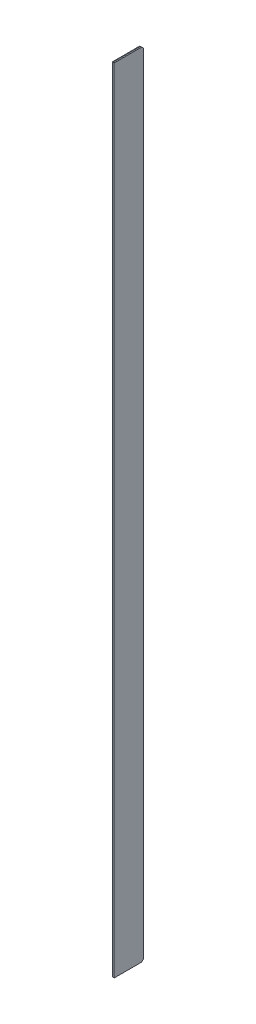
ISO-10303-21;
HEADER;
FILE_DESCRIPTION(('STEP AP214'),'2;1');
FILE_NAME('part.step','',(''),(''),'','','');
FILE_SCHEMA(('AUTOMOTIVE_DESIGN { 1 0 10303 214 1 1 1 1 }'));
ENDSEC;
DATA;
#1=APPLICATION_CONTEXT('core data for automotive mechanical design processes');
#2=APPLICATION_PROTOCOL_DEFINITION('international standard','automotive_design',2000,#1);
#3=PRODUCT_CONTEXT('',#1,'mechanical');
#4=PRODUCT('Part','Part','',(#3));
#5=PRODUCT_RELATED_PRODUCT_CATEGORY('part','',(#4));
#6=PRODUCT_DEFINITION_FORMATION('','',#4);
#7=PRODUCT_DEFINITION_CONTEXT('part definition',#1,'design');
#8=PRODUCT_DEFINITION('design','',#6,#7);
#9=PRODUCT_DEFINITION_SHAPE('','',#8);
#10=(LENGTH_UNIT() NAMED_UNIT(*) SI_UNIT(.MILLI.,.METRE.));
#11=(NAMED_UNIT(*) PLANE_ANGLE_UNIT() SI_UNIT($,.RADIAN.));
#12=(NAMED_UNIT(*) SI_UNIT($,.STERADIAN.) SOLID_ANGLE_UNIT());
#13=UNCERTAINTY_MEASURE_WITH_UNIT(LENGTH_MEASURE(1.E-05),#10,'distance_accuracy_value','');
#14=(GEOMETRIC_REPRESENTATION_CONTEXT(3) GLOBAL_UNCERTAINTY_ASSIGNED_CONTEXT((#13)) GLOBAL_UNIT_ASSIGNED_CONTEXT((#10,
#11,#12)) REPRESENTATION_CONTEXT('',''));
#15=CARTESIAN_POINT('',(0.,0.,0.));
#16=DIRECTION('',(0.,0.,1.));
#17=DIRECTION('',(1.,0.,0.));
#18=AXIS2_PLACEMENT_3D('',#15,#16,#17);
#19=CARTESIAN_POINT('',(19.05,16422.825,304.8));
#20=DIRECTION('',(-1.,0.,0.));
#21=DIRECTION('',(0.,0.,1.));
#22=AXIS2_PLACEMENT_3D('',#19,#20,#21);
#23=PLANE('',#22);
#24=DIRECTION('',(0.,-0.707106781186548,0.707106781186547));
#25=VECTOR('',#24,1.);
#26=CARTESIAN_POINT('',(19.05,0.,-249.8));
#27=LINE('',#26,#25);
#28=CARTESIAN_POINT('',(19.05,55.,-304.8));
#29=VERTEX_POINT('',#28);
#30=CARTESIAN_POINT('',(19.05,12.9999999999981,-262.799999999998));
#31=VERTEX_POINT('',#30);
#32=EDGE_CURVE('E65',#29,#31,#27,.T.);
#33=ORIENTED_EDGE('',*,*,#32,.F.);
#34=DIRECTION('',(0.,-1.,0.));
#35=VECTOR('',#34,1.);
#36=CARTESIAN_POINT('',(19.05,16422.825,-304.8));
#37=LINE('',#36,#35);
#38=CARTESIAN_POINT('',(19.05,16367.825,-304.8));
#39=VERTEX_POINT('',#38);
#40=EDGE_CURVE('E139',#39,#29,#37,.T.);
#41=ORIENTED_EDGE('',*,*,#40,.F.);
#42=DIRECTION('',(0.,-0.707106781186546,-0.707106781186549));
#43=VECTOR('',#42,1.);
#44=CARTESIAN_POINT('',(19.05,16422.825,-249.8));
#45=LINE('',#44,#43);
#46=CARTESIAN_POINT('',(19.05,16409.825,-262.800000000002));
#47=VERTEX_POINT('',#46);
#48=EDGE_CURVE('E142',#47,#39,#45,.T.);
#49=ORIENTED_EDGE('',*,*,#48,.F.);
#50=DIRECTION('',(0.,0.,1.));
#51=VECTOR('',#50,1.);
#52=CARTESIAN_POINT('',(19.05,16409.825,304.8));
#53=LINE('',#52,#51);
#54=CARTESIAN_POINT('',(19.05,16409.825,304.8));
#55=VERTEX_POINT('',#54);
#56=EDGE_CURVE('E176',#47,#55,#53,.T.);
#57=ORIENTED_EDGE('',*,*,#56,.T.);
#58=DIRECTION('',(0.,-1.,0.));
#59=VECTOR('',#58,1.);
#60=CARTESIAN_POINT('',(19.05,16422.825,304.8));
#61=LINE('',#60,#59);
#62=CARTESIAN_POINT('',(19.05,12.9999999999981,304.8));
#63=VERTEX_POINT('',#62);
#64=EDGE_CURVE('E146',#55,#63,#61,.T.);
#65=ORIENTED_EDGE('',*,*,#64,.T.);
#66=DIRECTION('',(0.,0.,-1.));
#67=VECTOR('',#66,1.);
#68=CARTESIAN_POINT('',(19.05,12.9999999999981,304.8));
#69=LINE('',#68,#67);
#70=EDGE_CURVE('E136',#63,#31,#69,.T.);
#71=ORIENTED_EDGE('',*,*,#70,.T.);
#72=EDGE_LOOP('',(#33,#41,#49,#57,#65,#71));
#73=FACE_BOUND('',#72,.T.);
#74=ADVANCED_FACE('F46',(#73),#23,.F.);
#75=CARTESIAN_POINT('',(19.05,16422.825,-304.8));
#76=DIRECTION('',(0.,0.,1.));
#77=DIRECTION('',(1.,0.,0.));
#78=AXIS2_PLACEMENT_3D('',#75,#76,#77);
#79=PLANE('',#78);
#80=DIRECTION('',(1.,0.,0.));
#81=VECTOR('',#80,1.);
#82=CARTESIAN_POINT('',(-19.05,55.,-304.8));
#83=LINE('',#82,#81);
#84=CARTESIAN_POINT('',(-19.05,55.,-304.8));
#85=VERTEX_POINT('',#84);
#86=EDGE_CURVE('E124',#85,#29,#83,.T.);
#87=ORIENTED_EDGE('',*,*,#86,.F.);
#88=DIRECTION('',(0.,-1.,0.));
#89=VECTOR('',#88,1.);
#90=CARTESIAN_POINT('',(-19.05,16422.825,-304.8));
#91=LINE('',#90,#89);
#92=CARTESIAN_POINT('',(-19.05,16367.825,-304.8));
#93=VERTEX_POINT('',#92);
#94=EDGE_CURVE('E149',#93,#85,#91,.T.);
#95=ORIENTED_EDGE('',*,*,#94,.F.);
#96=DIRECTION('',(1.,0.,0.));
#97=VECTOR('',#96,1.);
#98=CARTESIAN_POINT('',(-19.05,16367.825,-304.8));
#99=LINE('',#98,#97);
#100=EDGE_CURVE('E148',#93,#39,#99,.T.);
#101=ORIENTED_EDGE('',*,*,#100,.T.);
#102=ORIENTED_EDGE('',*,*,#40,.T.);
#103=EDGE_LOOP('',(#87,#95,#101,#102));
#104=FACE_BOUND('',#103,.T.);
#105=ADVANCED_FACE('F144',(#104),#79,.F.);
#106=CARTESIAN_POINT('',(-19.05,16422.825,304.8));
#107=DIRECTION('',(1.,0.,0.));
#108=DIRECTION('',(0.,0.,-1.));
#109=AXIS2_PLACEMENT_3D('',#106,#107,#108);
#110=PLANE('',#109);
#111=ORIENTED_EDGE('',*,*,#94,.T.);
#112=DIRECTION('',(0.,-0.707106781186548,0.707106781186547));
#113=VECTOR('',#112,1.);
#114=CARTESIAN_POINT('',(-19.05,0.,-249.8));
#115=LINE('',#114,#113);
#116=CARTESIAN_POINT('',(-19.05,12.9999999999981,-262.799999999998));
#117=VERTEX_POINT('',#116);
#118=EDGE_CURVE('E121',#85,#117,#115,.T.);
#119=ORIENTED_EDGE('',*,*,#118,.T.);
#120=DIRECTION('',(0.,0.,1.));
#121=VECTOR('',#120,1.);
#122=CARTESIAN_POINT('',(-19.05,12.9999999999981,304.8));
#123=LINE('',#122,#121);
#124=CARTESIAN_POINT('',(-19.05,12.9999999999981,304.8));
#125=VERTEX_POINT('',#124);
#126=EDGE_CURVE('E189',#117,#125,#123,.T.);
#127=ORIENTED_EDGE('',*,*,#126,.T.);
#128=DIRECTION('',(0.,-1.,0.));
#129=VECTOR('',#128,1.);
#130=CARTESIAN_POINT('',(-19.05,16422.825,304.8));
#131=LINE('',#130,#129);
#132=CARTESIAN_POINT('',(-19.05,16409.825,304.8));
#133=VERTEX_POINT('',#132);
#134=EDGE_CURVE('E153',#133,#125,#131,.T.);
#135=ORIENTED_EDGE('',*,*,#134,.F.);
#136=DIRECTION('',(0.,0.,-1.));
#137=VECTOR('',#136,1.);
#138=CARTESIAN_POINT('',(-19.05,16409.825,-304.8));
#139=LINE('',#138,#137);
#140=CARTESIAN_POINT('',(-19.05,16409.825,-262.800000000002));
#141=VERTEX_POINT('',#140);
#142=EDGE_CURVE('E183',#133,#141,#139,.T.);
#143=ORIENTED_EDGE('',*,*,#142,.T.);
#144=DIRECTION('',(0.,-0.707106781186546,-0.707106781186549));
#145=VECTOR('',#144,1.);
#146=CARTESIAN_POINT('',(-19.05,16422.825,-249.8));
#147=LINE('',#146,#145);
#148=EDGE_CURVE('E66',#141,#93,#147,.T.);
#149=ORIENTED_EDGE('',*,*,#148,.T.);
#150=EDGE_LOOP('',(#111,#119,#127,#135,#143,#149));
#151=FACE_BOUND('',#150,.T.);
#152=ADVANCED_FACE('F255',(#151),#110,.F.);
#153=CARTESIAN_POINT('',(19.05,16422.825,304.8));
#154=DIRECTION('',(0.,0.,-1.));
#155=DIRECTION('',(-1.,0.,0.));
#156=AXIS2_PLACEMENT_3D('',#153,#154,#155);
#157=PLANE('',#156);
#158=ORIENTED_EDGE('',*,*,#134,.T.);
#159=DIRECTION('',(1.,0.,0.));
#160=VECTOR('',#159,1.);
#161=CARTESIAN_POINT('',(19.05,12.9999999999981,304.8));
#162=LINE('',#161,#160);
#163=EDGE_CURVE('E164',#125,#63,#162,.T.);
#164=ORIENTED_EDGE('',*,*,#163,.T.);
#165=ORIENTED_EDGE('',*,*,#64,.F.);
#166=DIRECTION('',(-1.,0.,0.));
#167=VECTOR('',#166,1.);
#168=CARTESIAN_POINT('',(-19.05,16409.825,304.8));
#169=LINE('',#168,#167);
#170=EDGE_CURVE('E165',#55,#133,#169,.T.);
#171=ORIENTED_EDGE('',*,*,#170,.T.);
#172=EDGE_LOOP('',(#158,#164,#165,#171));
#173=FACE_BOUND('',#172,.T.);
#174=ADVANCED_FACE('F268',(#173),#157,.F.);
#175=CARTESIAN_POINT('',(0.,16422.825,0.));
#176=DIRECTION('',(0.,1.,0.));
#177=DIRECTION('',(0.,0.,1.));
#178=AXIS2_PLACEMENT_3D('',#175,#176,#177);
#179=PLANE('',#178);
#180=DIRECTION('',(1.,0.,0.));
#181=VECTOR('',#180,1.);
#182=CARTESIAN_POINT('',(-19.05,16422.825,-249.8));
#183=LINE('',#182,#181);
#184=CARTESIAN_POINT('',(-6.04999999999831,16422.825,-249.8));
#185=VERTEX_POINT('',#184);
#186=CARTESIAN_POINT('',(6.04999999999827,16422.825,-249.8));
#187=VERTEX_POINT('',#186);
#188=EDGE_CURVE('E217',#185,#187,#183,.T.);
#189=ORIENTED_EDGE('',*,*,#188,.F.);
#190=DIRECTION('',(0.,0.,1.));
#191=VECTOR('',#190,1.);
#192=CARTESIAN_POINT('',(-6.04999999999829,16422.825,304.8));
#193=LINE('',#192,#191);
#194=CARTESIAN_POINT('',(-6.04999999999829,16422.825,291.799999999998));
#195=VERTEX_POINT('',#194);
#196=EDGE_CURVE('E194',#185,#195,#193,.T.);
#197=ORIENTED_EDGE('',*,*,#196,.T.);
#198=DIRECTION('',(1.,0.,0.));
#199=VECTOR('',#198,1.);
#200=CARTESIAN_POINT('',(19.05,16422.825,291.799999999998));
#201=LINE('',#200,#199);
#202=CARTESIAN_POINT('',(6.04999999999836,16422.825,291.799999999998));
#203=VERTEX_POINT('',#202);
#204=EDGE_CURVE('E191',#195,#203,#201,.T.);
#205=ORIENTED_EDGE('',*,*,#204,.T.);
#206=DIRECTION('',(0.,0.,-1.));
#207=VECTOR('',#206,1.);
#208=CARTESIAN_POINT('',(6.04999999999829,16422.825,-304.8));
#209=LINE('',#208,#207);
#210=EDGE_CURVE('E196',#203,#187,#209,.T.);
#211=ORIENTED_EDGE('',*,*,#210,.T.);
#212=EDGE_LOOP('',(#189,#197,#205,#211));
#213=FACE_BOUND('',#212,.T.);
#214=ADVANCED_FACE('F221',(#213),#179,.T.);
#215=CARTESIAN_POINT('',(0.,0.,0.));
#216=DIRECTION('',(0.,1.,0.));
#217=DIRECTION('',(0.,0.,1.));
#218=AXIS2_PLACEMENT_3D('',#215,#216,#217);
#219=PLANE('',#218);
#220=DIRECTION('',(0.,0.,-1.));
#221=VECTOR('',#220,1.);
#222=CARTESIAN_POINT('',(-6.0500000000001,0.,0.));
#223=LINE('',#222,#221);
#224=CARTESIAN_POINT('',(-6.05000000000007,0.,291.8));
#225=VERTEX_POINT('',#224);
#226=CARTESIAN_POINT('',(-6.05000000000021,0.,-249.8));
#227=VERTEX_POINT('',#226);
#228=EDGE_CURVE('E166',#225,#227,#223,.T.);
#229=ORIENTED_EDGE('',*,*,#228,.T.);
#230=DIRECTION('',(1.,0.,0.));
#231=VECTOR('',#230,1.);
#232=CARTESIAN_POINT('',(-19.05,0.,-249.8));
#233=LINE('',#232,#231);
#234=CARTESIAN_POINT('',(6.05000000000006,0.,-249.8));
#235=VERTEX_POINT('',#234);
#236=EDGE_CURVE('E132',#227,#235,#233,.T.);
#237=ORIENTED_EDGE('',*,*,#236,.T.);
#238=DIRECTION('',(0.,0.,1.));
#239=VECTOR('',#238,1.);
#240=CARTESIAN_POINT('',(6.0500000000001,0.,0.));
#241=LINE('',#240,#239);
#242=CARTESIAN_POINT('',(6.05000000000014,0.,291.8));
#243=VERTEX_POINT('',#242);
#244=EDGE_CURVE('E173',#235,#243,#241,.T.);
#245=ORIENTED_EDGE('',*,*,#244,.T.);
#246=DIRECTION('',(-1.,0.,0.));
#247=VECTOR('',#246,1.);
#248=CARTESIAN_POINT('',(0.,0.,291.8));
#249=LINE('',#248,#247);
#250=EDGE_CURVE('E178',#243,#225,#249,.T.);
#251=ORIENTED_EDGE('',*,*,#250,.T.);
#252=EDGE_LOOP('',(#229,#237,#245,#251));
#253=FACE_BOUND('',#252,.T.);
#254=ADVANCED_FACE('F274',(#253),#219,.F.);
#255=CARTESIAN_POINT('',(-19.05,12.9999999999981,304.8));
#256=DIRECTION('',(0.707106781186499,0.707106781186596,0.));
#257=DIRECTION('',(0.,0.,1.));
#258=AXIS2_PLACEMENT_3D('',#255,#256,#257);
#259=PLANE('',#258);
#260=DIRECTION('',(0.577350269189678,-0.5773502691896,0.577350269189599));
#261=VECTOR('',#260,1.);
#262=CARTESIAN_POINT('',(170.150000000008,-176.199999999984,-73.600000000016));
#263=LINE('',#262,#261);
#264=EDGE_CURVE('E215',#227,#117,#263,.F.);
#265=ORIENTED_EDGE('',*,*,#264,.F.);
#266=ORIENTED_EDGE('',*,*,#228,.F.);
#267=DIRECTION('',(-0.577350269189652,0.577350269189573,0.577350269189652));
#268=VECTOR('',#267,1.);
#269=CARTESIAN_POINT('',(-19.05,12.9999999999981,304.8));
#270=LINE('',#269,#268);
#271=EDGE_CURVE('E154',#125,#225,#270,.F.);
#272=ORIENTED_EDGE('',*,*,#271,.F.);
#273=ORIENTED_EDGE('',*,*,#126,.F.);
#274=EDGE_LOOP('',(#265,#266,#272,#273));
#275=FACE_BOUND('',#274,.T.);
#276=ADVANCED_FACE('F259',(#275),#259,.F.);
#277=CARTESIAN_POINT('',(19.05,12.9999999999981,304.8));
#278=DIRECTION('',(-0.707106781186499,0.707106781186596,0.));
#279=DIRECTION('',(0.,0.,-1.));
#280=AXIS2_PLACEMENT_3D('',#277,#278,#279);
#281=PLANE('',#280);
#282=DIRECTION('',(0.577350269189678,0.5773502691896,-0.577350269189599));
#283=VECTOR('',#282,1.);
#284=CARTESIAN_POINT('',(-170.150000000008,-176.199999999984,-73.600000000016));
#285=LINE('',#284,#283);
#286=EDGE_CURVE('E11',#31,#235,#285,.F.);
#287=ORIENTED_EDGE('',*,*,#286,.F.);
#288=ORIENTED_EDGE('',*,*,#70,.F.);
#289=DIRECTION('',(-0.577350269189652,-0.577350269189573,-0.577350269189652));
#290=VECTOR('',#289,1.);
#291=CARTESIAN_POINT('',(19.05,12.9999999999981,304.8));
#292=LINE('',#291,#290);
#293=EDGE_CURVE('E205',#243,#63,#292,.F.);
#294=ORIENTED_EDGE('',*,*,#293,.F.);
#295=ORIENTED_EDGE('',*,*,#244,.F.);
#296=EDGE_LOOP('',(#287,#288,#294,#295));
#297=FACE_BOUND('',#296,.T.);
#298=ADVANCED_FACE('F317',(#297),#281,.F.);
#299=CARTESIAN_POINT('',(19.05,12.9999999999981,304.8));
#300=DIRECTION('',(0.,0.707106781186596,-0.707106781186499));
#301=DIRECTION('',(1.,0.,0.));
#302=AXIS2_PLACEMENT_3D('',#299,#300,#301);
#303=PLANE('',#302);
#304=ORIENTED_EDGE('',*,*,#271,.T.);
#305=ORIENTED_EDGE('',*,*,#250,.F.);
#306=ORIENTED_EDGE('',*,*,#293,.T.);
#307=ORIENTED_EDGE('',*,*,#163,.F.);
#308=EDGE_LOOP('',(#304,#305,#306,#307));
#309=FACE_BOUND('',#308,.T.);
#310=ADVANCED_FACE('F262',(#309),#303,.F.);
#311=CARTESIAN_POINT('',(0.,16422.825,291.799999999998));
#312=DIRECTION('',(0.,0.707106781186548,0.707106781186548));
#313=DIRECTION('',(-1.,0.,0.));
#314=AXIS2_PLACEMENT_3D('',#311,#312,#313);
#315=PLANE('',#314);
#316=DIRECTION('',(0.577350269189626,0.577350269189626,-0.577350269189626));
#317=VECTOR('',#316,1.);
#318=CARTESIAN_POINT('',(91.2166666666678,16520.0916666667,194.533333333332));
#319=LINE('',#318,#317);
#320=EDGE_CURVE('E208',#133,#195,#319,.T.);
#321=ORIENTED_EDGE('',*,*,#320,.F.);
#322=ORIENTED_EDGE('',*,*,#170,.F.);
#323=DIRECTION('',(-0.577350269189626,0.577350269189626,-0.577350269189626));
#324=VECTOR('',#323,1.);
#325=CARTESIAN_POINT('',(4.03333333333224,16424.8416666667,289.783333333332));
#326=LINE('',#325,#324);
#327=EDGE_CURVE('E202',#203,#55,#326,.F.);
#328=ORIENTED_EDGE('',*,*,#327,.F.);
#329=ORIENTED_EDGE('',*,*,#204,.F.);
#330=EDGE_LOOP('',(#321,#322,#328,#329));
#331=FACE_BOUND('',#330,.T.);
#332=ADVANCED_FACE('F47',(#331),#315,.T.);
#333=CARTESIAN_POINT('',(6.04999999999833,16422.825,0.));
#334=DIRECTION('',(0.707106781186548,0.707106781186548,0.));
#335=DIRECTION('',(0.,0.,1.));
#336=AXIS2_PLACEMENT_3D('',#333,#334,#335);
#337=PLANE('',#336);
#338=DIRECTION('',(0.577350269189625,-0.577350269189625,-0.577350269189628));
#339=VECTOR('',#338,1.);
#340=CARTESIAN_POINT('',(-77.2166666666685,16506.0916666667,-166.533333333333));
#341=LINE('',#340,#339);
#342=EDGE_CURVE('E240',#187,#47,#341,.T.);
#343=ORIENTED_EDGE('',*,*,#342,.F.);
#344=ORIENTED_EDGE('',*,*,#210,.F.);
#345=ORIENTED_EDGE('',*,*,#327,.T.);
#346=ORIENTED_EDGE('',*,*,#56,.F.);
#347=EDGE_LOOP('',(#343,#344,#345,#346));
#348=FACE_BOUND('',#347,.T.);
#349=ADVANCED_FACE('F237',(#348),#337,.T.);
#350=CARTESIAN_POINT('',(-6.04999999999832,16422.825,0.));
#351=DIRECTION('',(-0.707106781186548,0.707106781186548,0.));
#352=DIRECTION('',(0.,0.,-1.));
#353=AXIS2_PLACEMENT_3D('',#350,#351,#352);
#354=PLANE('',#353);
#355=DIRECTION('',(0.577350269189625,0.577350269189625,0.577350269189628));
#356=VECTOR('',#355,1.);
#357=CARTESIAN_POINT('',(77.2166666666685,16506.0916666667,-166.533333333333));
#358=LINE('',#357,#356);
#359=EDGE_CURVE('E57',#141,#185,#358,.T.);
#360=ORIENTED_EDGE('',*,*,#359,.F.);
#361=ORIENTED_EDGE('',*,*,#142,.F.);
#362=ORIENTED_EDGE('',*,*,#320,.T.);
#363=ORIENTED_EDGE('',*,*,#196,.F.);
#364=EDGE_LOOP('',(#360,#361,#362,#363));
#365=FACE_BOUND('',#364,.T.);
#366=ADVANCED_FACE('F229',(#365),#354,.T.);
#367=CARTESIAN_POINT('',(-19.05,16422.825,-249.8));
#368=DIRECTION('',(0.,-0.707106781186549,0.707106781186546));
#369=DIRECTION('',(0.,-0.707106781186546,-0.707106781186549));
#370=AXIS2_PLACEMENT_3D('',#367,#368,#369);
#371=PLANE('',#370);
#372=ORIENTED_EDGE('',*,*,#342,.T.);
#373=ORIENTED_EDGE('',*,*,#48,.T.);
#374=ORIENTED_EDGE('',*,*,#100,.F.);
#375=ORIENTED_EDGE('',*,*,#148,.F.);
#376=ORIENTED_EDGE('',*,*,#359,.T.);
#377=ORIENTED_EDGE('',*,*,#188,.T.);
#378=EDGE_LOOP('',(#372,#373,#374,#375,#376,#377));
#379=FACE_BOUND('',#378,.T.);
#380=ADVANCED_FACE('F220',(#379),#371,.F.);
#381=CARTESIAN_POINT('',(-19.05,0.,-249.8));
#382=DIRECTION('',(0.,0.707106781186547,0.707106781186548));
#383=DIRECTION('',(0.,-0.707106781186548,0.707106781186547));
#384=AXIS2_PLACEMENT_3D('',#381,#382,#383);
#385=PLANE('',#384);
#386=ORIENTED_EDGE('',*,*,#264,.T.);
#387=ORIENTED_EDGE('',*,*,#118,.F.);
#388=ORIENTED_EDGE('',*,*,#86,.T.);
#389=ORIENTED_EDGE('',*,*,#32,.T.);
#390=ORIENTED_EDGE('',*,*,#286,.T.);
#391=ORIENTED_EDGE('',*,*,#236,.F.);
#392=EDGE_LOOP('',(#386,#387,#388,#389,#390,#391));
#393=FACE_BOUND('',#392,.T.);
#394=ADVANCED_FACE('F122',(#393),#385,.F.);
#395=CLOSED_SHELL('',(#74,#105,#152,#174,#214,#254,#276,#298,#310,#332,#349,#366,#380,#394));
#396=MANIFOLD_SOLID_BREP('B2',#395);
#397=ADVANCED_BREP_SHAPE_REPRESENTATION('',(#18,#396),#14);
#398=SHAPE_DEFINITION_REPRESENTATION(#9,#397);
ENDSEC;
END-ISO-10303-21;
